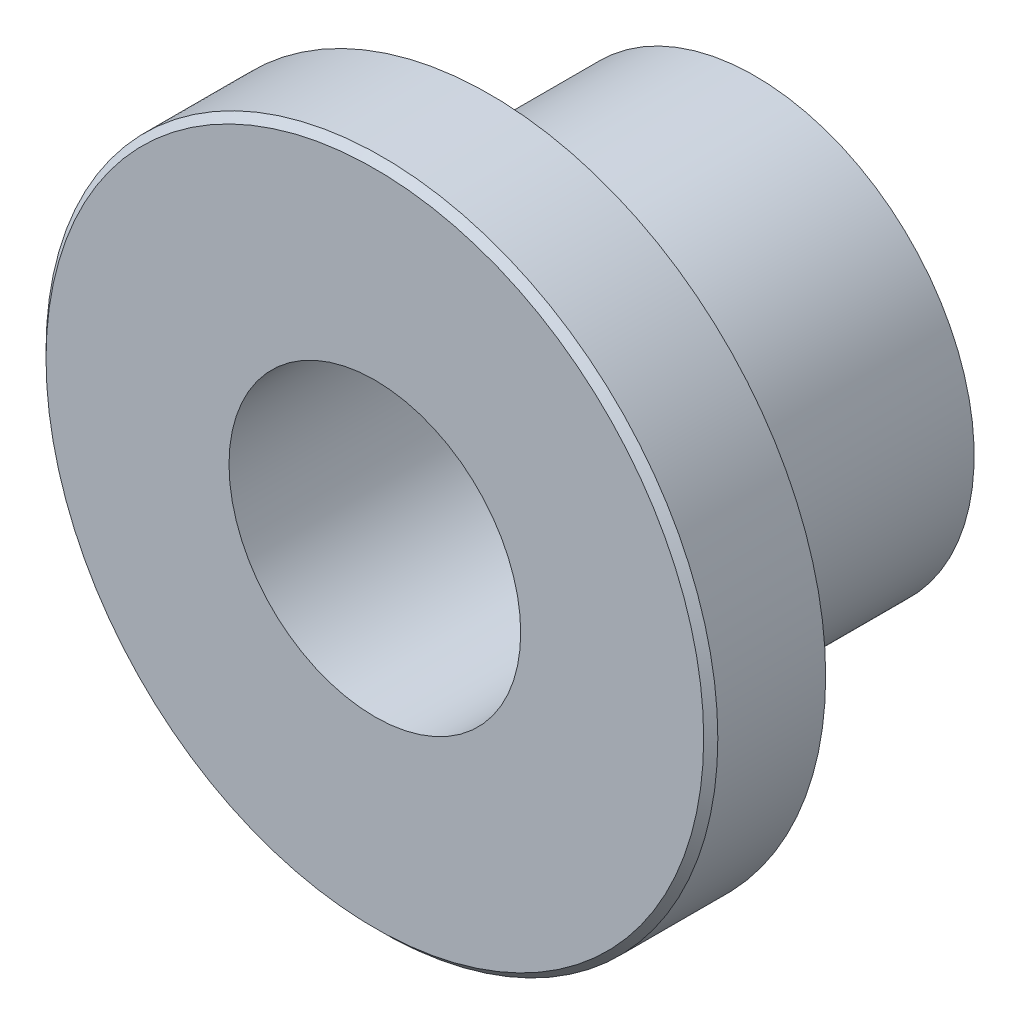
ISO-10303-21;
HEADER;
FILE_DESCRIPTION(('STEP AP214'),'2;1');
FILE_NAME('part.step','',(''),(''),'','','');
FILE_SCHEMA(('AUTOMOTIVE_DESIGN { 1 0 10303 214 1 1 1 1 }'));
ENDSEC;
DATA;
#1=APPLICATION_CONTEXT('core data for automotive mechanical design processes');
#2=APPLICATION_PROTOCOL_DEFINITION('international standard','automotive_design',2000,#1);
#3=PRODUCT_CONTEXT('',#1,'mechanical');
#4=PRODUCT('Part','Part','',(#3));
#5=PRODUCT_RELATED_PRODUCT_CATEGORY('part','',(#4));
#6=PRODUCT_DEFINITION_FORMATION('','',#4);
#7=PRODUCT_DEFINITION_CONTEXT('part definition',#1,'design');
#8=PRODUCT_DEFINITION('design','',#6,#7);
#9=PRODUCT_DEFINITION_SHAPE('','',#8);
#10=(LENGTH_UNIT() NAMED_UNIT(*) SI_UNIT(.MILLI.,.METRE.));
#11=(NAMED_UNIT(*) PLANE_ANGLE_UNIT() SI_UNIT($,.RADIAN.));
#12=(NAMED_UNIT(*) SI_UNIT($,.STERADIAN.) SOLID_ANGLE_UNIT());
#13=UNCERTAINTY_MEASURE_WITH_UNIT(LENGTH_MEASURE(1.E-05),#10,'distance_accuracy_value','');
#14=(GEOMETRIC_REPRESENTATION_CONTEXT(3) GLOBAL_UNCERTAINTY_ASSIGNED_CONTEXT((#13)) GLOBAL_UNIT_ASSIGNED_CONTEXT((#10,
#11,#12)) REPRESENTATION_CONTEXT('',''));
#15=CARTESIAN_POINT('',(0.,0.,0.));
#16=DIRECTION('',(0.,0.,1.));
#17=DIRECTION('',(1.,0.,0.));
#18=AXIS2_PLACEMENT_3D('',#15,#16,#17);
#19=CARTESIAN_POINT('',(0.,0.,0.));
#20=DIRECTION('',(0.,0.,-1.));
#21=DIRECTION('',(-1.,0.,0.));
#22=AXIS2_PLACEMENT_3D('',#19,#20,#21);
#23=PLANE('',#22);
#24=CARTESIAN_POINT('',(0.,0.,0.));
#25=DIRECTION('',(0.,0.,-1.));
#26=DIRECTION('',(-1.,0.,0.));
#27=AXIS2_PLACEMENT_3D('',#24,#25,#26);
#28=CIRCLE('',#27,12.8);
#29=CARTESIAN_POINT('',(-12.8,0.,0.));
#30=VERTEX_POINT('',#29);
#31=EDGE_CURVE('E8',#30,#30,#28,.F.);
#32=ORIENTED_EDGE('',*,*,#31,.T.);
#33=EDGE_LOOP('',(#32));
#34=FACE_BOUND('',#33,.T.);
#35=CARTESIAN_POINT('',(0.,0.,0.));
#36=DIRECTION('',(0.,0.,-1.));
#37=DIRECTION('',(-1.,0.,0.));
#38=AXIS2_PLACEMENT_3D('',#35,#36,#37);
#39=CIRCLE('',#38,19.);
#40=CARTESIAN_POINT('',(-19.,0.,0.));
#41=VERTEX_POINT('',#40);
#42=EDGE_CURVE('E36',#41,#41,#39,.F.);
#43=ORIENTED_EDGE('',*,*,#42,.F.);
#44=EDGE_LOOP('',(#43));
#45=FACE_BOUND('',#44,.T.);
#46=ADVANCED_FACE('F12',(#34,#45),#23,.T.);
#47=CARTESIAN_POINT('',(0.,0.,-15.));
#48=DIRECTION('',(0.,0.,-1.));
#49=DIRECTION('',(-1.,0.,0.));
#50=AXIS2_PLACEMENT_3D('',#47,#48,#49);
#51=PLANE('',#50);
#52=CARTESIAN_POINT('',(0.,0.,-15.));
#53=DIRECTION('',(0.,0.,-1.));
#54=DIRECTION('',(-1.,0.,0.));
#55=AXIS2_PLACEMENT_3D('',#52,#53,#54);
#56=CIRCLE('',#55,8.25);
#57=CARTESIAN_POINT('',(-8.25,0.,-15.));
#58=VERTEX_POINT('',#57);
#59=EDGE_CURVE('E33',#58,#58,#56,.T.);
#60=ORIENTED_EDGE('',*,*,#59,.F.);
#61=EDGE_LOOP('',(#60));
#62=FACE_BOUND('',#61,.T.);
#63=CARTESIAN_POINT('',(0.,0.,-15.));
#64=DIRECTION('',(0.,0.,-1.));
#65=DIRECTION('',(-1.,0.,0.));
#66=AXIS2_PLACEMENT_3D('',#63,#64,#65);
#67=CIRCLE('',#66,12.4);
#68=CARTESIAN_POINT('',(-12.4,0.,-15.));
#69=VERTEX_POINT('',#68);
#70=EDGE_CURVE('E41',#69,#69,#67,.T.);
#71=ORIENTED_EDGE('',*,*,#70,.T.);
#72=EDGE_LOOP('',(#71));
#73=FACE_BOUND('',#72,.T.);
#74=ADVANCED_FACE('F45',(#62,#73),#51,.T.);
#75=CARTESIAN_POINT('',(0.,0.,6.5));
#76=DIRECTION('',(0.,0.,1.));
#77=DIRECTION('',(1.,0.,0.));
#78=AXIS2_PLACEMENT_3D('',#75,#76,#77);
#79=PLANE('',#78);
#80=CARTESIAN_POINT('',(0.,0.,6.5));
#81=DIRECTION('',(0.,0.,1.));
#82=DIRECTION('',(1.,0.,0.));
#83=AXIS2_PLACEMENT_3D('',#80,#81,#82);
#84=CIRCLE('',#83,18.6);
#85=CARTESIAN_POINT('',(18.6,0.,6.5));
#86=VERTEX_POINT('',#85);
#87=EDGE_CURVE('E23',#86,#86,#84,.T.);
#88=ORIENTED_EDGE('',*,*,#87,.T.);
#89=EDGE_LOOP('',(#88));
#90=FACE_BOUND('',#89,.T.);
#91=CARTESIAN_POINT('',(0.,0.,6.5));
#92=DIRECTION('',(0.,0.,-1.));
#93=DIRECTION('',(-1.,0.,0.));
#94=AXIS2_PLACEMENT_3D('',#91,#92,#93);
#95=CIRCLE('',#94,8.25);
#96=CARTESIAN_POINT('',(-8.25,0.,6.5));
#97=VERTEX_POINT('',#96);
#98=EDGE_CURVE('E32',#97,#97,#95,.F.);
#99=ORIENTED_EDGE('',*,*,#98,.F.);
#100=EDGE_LOOP('',(#99));
#101=FACE_BOUND('',#100,.T.);
#102=ADVANCED_FACE('F63',(#90,#101),#79,.T.);
#103=CARTESIAN_POINT('',(0.,0.,6.5));
#104=DIRECTION('',(0.,0.,-1.));
#105=DIRECTION('',(-1.,0.,0.));
#106=AXIS2_PLACEMENT_3D('',#103,#104,#105);
#107=CYLINDRICAL_SURFACE('',#106,8.25);
#108=ORIENTED_EDGE('',*,*,#59,.T.);
#109=EDGE_LOOP('',(#108));
#110=FACE_BOUND('',#109,.T.);
#111=ORIENTED_EDGE('',*,*,#98,.T.);
#112=EDGE_LOOP('',(#111));
#113=FACE_BOUND('',#112,.T.);
#114=ADVANCED_FACE('F61',(#110,#113),#107,.F.);
#115=CARTESIAN_POINT('',(0.,0.,-18.4329689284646));
#116=DIRECTION('',(0.,0.,-1.));
#117=DIRECTION('',(-1.,0.,0.));
#118=AXIS2_PLACEMENT_3D('',#115,#116,#117);
#119=CYLINDRICAL_SURFACE('',#118,19.);
#120=CARTESIAN_POINT('',(0.,0.,6.1));
#121=DIRECTION('',(0.,0.,1.));
#122=DIRECTION('',(1.,0.,0.));
#123=AXIS2_PLACEMENT_3D('',#120,#121,#122);
#124=CIRCLE('',#123,19.);
#125=CARTESIAN_POINT('',(19.,0.,6.1));
#126=VERTEX_POINT('',#125);
#127=EDGE_CURVE('E27',#126,#126,#124,.F.);
#128=ORIENTED_EDGE('',*,*,#127,.T.);
#129=EDGE_LOOP('',(#128));
#130=FACE_BOUND('',#129,.T.);
#131=ORIENTED_EDGE('',*,*,#42,.T.);
#132=EDGE_LOOP('',(#131));
#133=FACE_BOUND('',#132,.T.);
#134=ADVANCED_FACE('F58',(#130,#133),#119,.T.);
#135=CARTESIAN_POINT('',(0.,0.,6.1));
#136=DIRECTION('',(0.,0.,-1.));
#137=DIRECTION('',(-1.,0.,0.));
#138=AXIS2_PLACEMENT_3D('',#135,#136,#137);
#139=CONICAL_SURFACE('',#138,19.,0.785398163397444);
#140=ORIENTED_EDGE('',*,*,#87,.F.);
#141=EDGE_LOOP('',(#140));
#142=FACE_BOUND('',#141,.T.);
#143=ORIENTED_EDGE('',*,*,#127,.F.);
#144=EDGE_LOOP('',(#143));
#145=FACE_BOUND('',#144,.T.);
#146=ADVANCED_FACE('F49',(#142,#145),#139,.T.);
#147=CARTESIAN_POINT('',(0.,0.,35.0724963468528));
#148=DIRECTION('',(0.,0.,-1.));
#149=DIRECTION('',(-1.,0.,0.));
#150=AXIS2_PLACEMENT_3D('',#147,#148,#149);
#151=CYLINDRICAL_SURFACE('',#150,12.4);
#152=CARTESIAN_POINT('',(0.,0.,-0.4));
#153=DIRECTION('',(0.,0.,-1.));
#154=DIRECTION('',(-1.,0.,0.));
#155=AXIS2_PLACEMENT_3D('',#152,#153,#154);
#156=CIRCLE('',#155,12.4);
#157=CARTESIAN_POINT('',(-12.4,0.,-0.4));
#158=VERTEX_POINT('',#157);
#159=EDGE_CURVE('E19',#158,#158,#156,.T.);
#160=ORIENTED_EDGE('',*,*,#159,.T.);
#161=EDGE_LOOP('',(#160));
#162=FACE_BOUND('',#161,.T.);
#163=ORIENTED_EDGE('',*,*,#70,.F.);
#164=EDGE_LOOP('',(#163));
#165=FACE_BOUND('',#164,.T.);
#166=ADVANCED_FACE('F47',(#162,#165),#151,.T.);
#167=CARTESIAN_POINT('',(0.,0.,-0.4));
#168=DIRECTION('',(0.,0.,-1.));
#169=DIRECTION('',(-1.,0.,0.));
#170=AXIS2_PLACEMENT_3D('',#167,#168,#169);
#171=TOROIDAL_SURFACE('',#170,12.8,0.4);
#172=ORIENTED_EDGE('',*,*,#31,.F.);
#173=EDGE_LOOP('',(#172));
#174=FACE_BOUND('',#173,.T.);
#175=ORIENTED_EDGE('',*,*,#159,.F.);
#176=EDGE_LOOP('',(#175));
#177=FACE_BOUND('',#176,.T.);
#178=ADVANCED_FACE('F14',(#174,#177),#171,.F.);
#179=CLOSED_SHELL('',(#46,#74,#102,#114,#134,#146,#166,#178));
#180=MANIFOLD_SOLID_BREP('B1',#179);
#181=ADVANCED_BREP_SHAPE_REPRESENTATION('',(#18,#180),#14);
#182=SHAPE_DEFINITION_REPRESENTATION(#9,#181);
ENDSEC;
END-ISO-10303-21;
